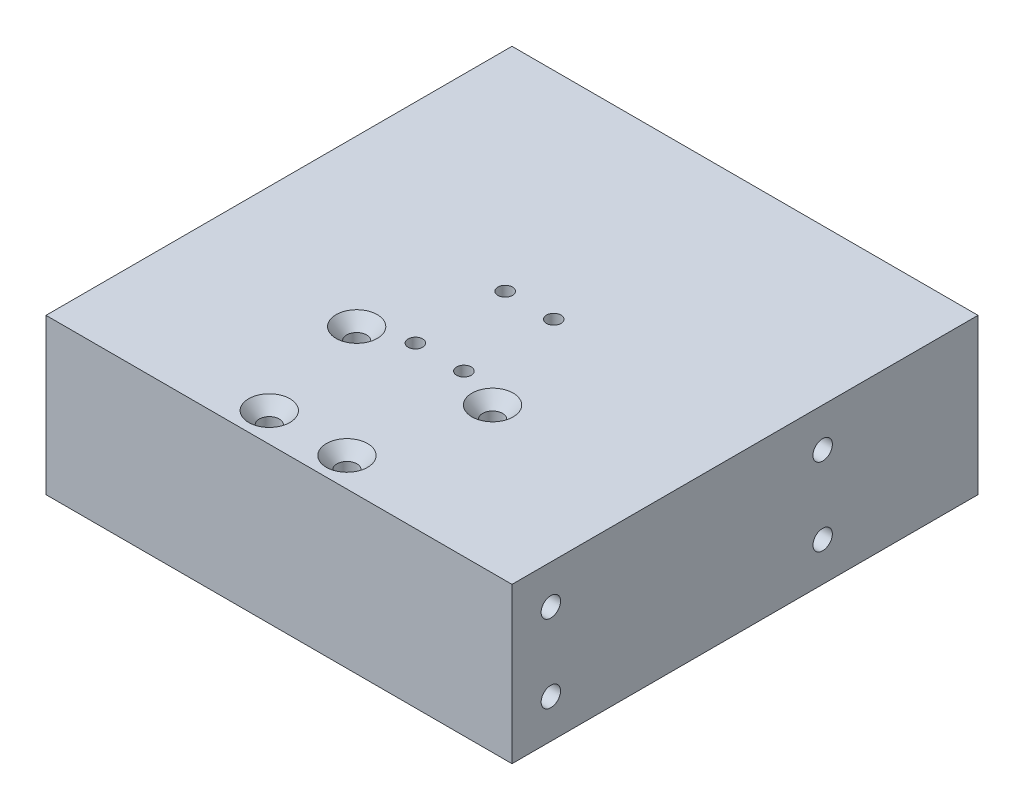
from build123d import *

# Parameters (mm, degrees)
SKETCH1_W                                           = 152.4
SKETCH1_H                                           = 152.4
BOSS_EXTRUDE1_DEPTH                                 = 50.8
CSK_FOR_1_4_FLAT_HEAD_SOCKET_CAP_SCREW1_D           = 6.5278
CSK_FOR_1_4_FLAT_HEAD_SOCKET_CAP_SCREW1_CSINK_D     = 13.4874
CSK_FOR_1_4_FLAT_HEAD_SOCKET_CAP_SCREW1_CSINK_ANGLE = 82
F_3_16_0_1875_DIAMETER_HOLE2_D                      = 4.7625
F_3_16_0_1875_DIAMETER_HOLE2_DEPTH                  = 6.0452
F_3_16_0_1875_DIAMETER_HOLE2_TIP                    = 1.430799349
F_1_4_0_25_DIAMETER_HOLE2_AT_2_COUNT                = 2
F_1_4_0_25_DIAMETER_HOLE2_AT_2_PITCH                = 453.328793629
F_1_4_0_25_DIAMETER_HOLE2_AT_3_COUNT                = 2
F_1_4_0_25_DIAMETER_HOLE2_AT_3_PITCH                = 365.071644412
F_1_4_0_25_DIAMETER_HOLE2_AT_4_COUNT                = 2
F_1_4_0_25_DIAMETER_HOLE2_AT_4_PITCH                = 369.327840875
F_1_4_0_25_DIAMETER_HOLE2_AT_5_COUNT                = 2
F_1_4_0_25_DIAMETER_HOLE2_AT_5_PITCH                = 456.76333437
SKETCH9_W                                           = 9.525
SKETCH9_H                                           = 6.35
CUT_EXTRUDE1_DEPTH                                  = 38.1


with BuildPart() as part:
    # Sketch1 → Boss-Extrude1 (new body)
    with BuildSketch(Plane(origin=(0, 0, 0), x_dir=(1, 0, 0), z_dir=(0, 1, 0))):
        with Locations((76.2, 76.2)):
            Rectangle(SKETCH1_W, SKETCH1_H)
    extrude(amount=BOSS_EXTRUDE1_DEPTH)

    # CSK for 1_4 Flat Head Socket Cap Screw1 (through all)
    with Locations(Plane(origin=(0, 50.8, 0), x_dir=(1, 0, 0), z_dir=(0, 1, 0))):
        with Locations((98.425, 47.625), (53.975, 47.625), (53.975, -28.575), (98.425, -28.575), (88.9, 9.525), (63.5, 9.525)):
            CounterSinkHole(CSK_FOR_1_4_FLAT_HEAD_SOCKET_CAP_SCREW1_D / 2, CSK_FOR_1_4_FLAT_HEAD_SOCKET_CAP_SCREW1_CSINK_D / 2, counter_sink_angle=CSK_FOR_1_4_FLAT_HEAD_SOCKET_CAP_SCREW1_CSINK_ANGLE)

    # 3_16 _0.1875_ Diameter Hole2
    with Locations(Plane(origin=(0, 50.8, 0), x_dir=(1, 0, 0), z_dir=(0, 1, 0))):
        with Locations((18.208873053, -414.702885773), (84.1375, 81.907375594), (68.2625, 81.907375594), (68.2625, 52.538625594), (84.1375, 52.538625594)):
            Hole(F_3_16_0_1875_DIAMETER_HOLE2_D / 2, depth=F_3_16_0_1875_DIAMETER_HOLE2_DEPTH)
            with Locations((0, 0, -(F_3_16_0_1875_DIAMETER_HOLE2_DEPTH + F_3_16_0_1875_DIAMETER_HOLE2_TIP / 2))):  # 118° drill point
                Cone(0, F_3_16_0_1875_DIAMETER_HOLE2_D / 2, F_3_16_0_1875_DIAMETER_HOLE2_TIP, mode=Mode.SUBTRACT)

    # Sketch7 → 1_4 _0.25_ Diameter Hole2 (revolve, cut)
    with BuildSketch(Plane(origin=(152.4, 86.930482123, 349.091223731), x_dir=(0, 0, -1), z_dir=(0, 1, 0))):
        Polygon((0, 0), (0, 8.664132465), (3.175, 6.7564), (3.175, 0), align=None)
    f_1_4_0_25_diameter_hole2 = revolve(axis=Axis((158.75, 86.930482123, 349.091223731), (-1, 0, 0)), mode=Mode.SUBTRACT)

    # 1_4 _0.25_ Diameter Hole2 at 2: 1_4 _0.25_ Diameter Hole2 ×2
    with Locations(*[Vector(0, -0.10771537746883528, -0.9941817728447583) * (i * F_1_4_0_25_DIAMETER_HOLE2_AT_2_PITCH) for i in range(1, F_1_4_0_25_DIAMETER_HOLE2_AT_2_COUNT)]):
        add(f_1_4_0_25_diameter_hole2, mode=Mode.SUBTRACT)

    # 1_4 _0.25_ Diameter Hole2 at 3: 1_4 _0.25_ Diameter Hole2 ×2
    with Locations(*[Vector(0, -0.13375588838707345, -0.9910143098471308) * (i * F_1_4_0_25_DIAMETER_HOLE2_AT_3_PITCH) for i in range(1, F_1_4_0_25_DIAMETER_HOLE2_AT_3_COUNT)]):
        add(f_1_4_0_25_diameter_hole2, mode=Mode.SUBTRACT)

    # 1_4 _0.25_ Diameter Hole2 at 4: 1_4 _0.25_ Diameter Hole2 ×2
    with Locations(*[Vector(0, -0.20098804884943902, -0.979593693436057) * (i * F_1_4_0_25_DIAMETER_HOLE2_AT_4_PITCH) for i in range(1, F_1_4_0_25_DIAMETER_HOLE2_AT_4_COUNT)]):
        add(f_1_4_0_25_diameter_hole2, mode=Mode.SUBTRACT)

    # 1_4 _0.25_ Diameter Hole2 at 5: 1_4 _0.25_ Diameter Hole2 ×2
    with Locations(*[Vector(0, -0.1625140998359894, -0.98670622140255) * (i * F_1_4_0_25_DIAMETER_HOLE2_AT_5_PITCH) for i in range(1, F_1_4_0_25_DIAMETER_HOLE2_AT_5_COUNT)]):
        add(f_1_4_0_25_diameter_hole2, mode=Mode.SUBTRACT)

    # Mirror1: 1_4 _0.25_ Diameter Hole2 across plane
    add(f_1_4_0_25_diameter_hole2.mirror(Plane(origin=(76.2, 0, 0), x_dir=(0, 0, 1), z_dir=(1, 0, 0))), mode=Mode.SUBTRACT)

    # Mirror1 copy 1 sketch → Mirror1 copy 1 (revolve, cut)
    with BuildSketch(Plane(origin=(0, 38.1, -101.6), x_dir=(0, 0, -1), z_dir=(0, 1, 0))):
        Polygon((0, 0), (0, -8.664132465), (3.175, -6.7564), (3.175, 0), align=None)
    revolve(axis=Axis((-6.35, 38.1, -101.6), (-1, 0, 0)), mode=Mode.SUBTRACT)

    # Mirror1 copy 2 sketch → Mirror1 copy 2 (revolve, cut)
    with BuildSketch(Plane(origin=(0, 38.1, -12.7), x_dir=(0, 0, -1), z_dir=(0, 1, 0))):
        Polygon((0, 0), (0, -8.664132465), (3.175, -6.7564), (3.175, 0), align=None)
    revolve(axis=Axis((-6.35, 38.1, -12.7), (-1, 0, 0)), mode=Mode.SUBTRACT)

    # Mirror1 copy 3 sketch → Mirror1 copy 3 (revolve, cut)
    with BuildSketch(Plane(origin=(0, 12.7, -12.7), x_dir=(0, 0, -1), z_dir=(0, 1, 0))):
        Polygon((0, 0), (0, -8.664132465), (3.175, -6.7564), (3.175, 0), align=None)
    revolve(axis=Axis((-6.35, 12.7, -12.7), (-1, 0, 0)), mode=Mode.SUBTRACT)

    # Mirror1 copy 4 sketch → Mirror1 copy 4 (revolve, cut)
    with BuildSketch(Plane(origin=(0, 12.7, -101.6), x_dir=(0, 0, -1), z_dir=(0, 1, 0))):
        Polygon((0, 0), (0, -8.664132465), (3.175, -6.7564), (3.175, 0), align=None)
    revolve(axis=Axis((-6.35, 12.7, -101.6), (-1, 0, 0)), mode=Mode.SUBTRACT)

    # Sketch9 → Cut-Extrude1 (cut, symmetric)
    with BuildSketch(Plane(origin=(76.2, 0, 0), x_dir=(0, 0, -1), z_dir=(1, 0, 0))):
        with Locations((147.6375, 3.175)):
            Rectangle(SKETCH9_W, SKETCH9_H)
    extrude(amount=CUT_EXTRUDE1_DEPTH, both=True, mode=Mode.SUBTRACT)


solid = part.part
